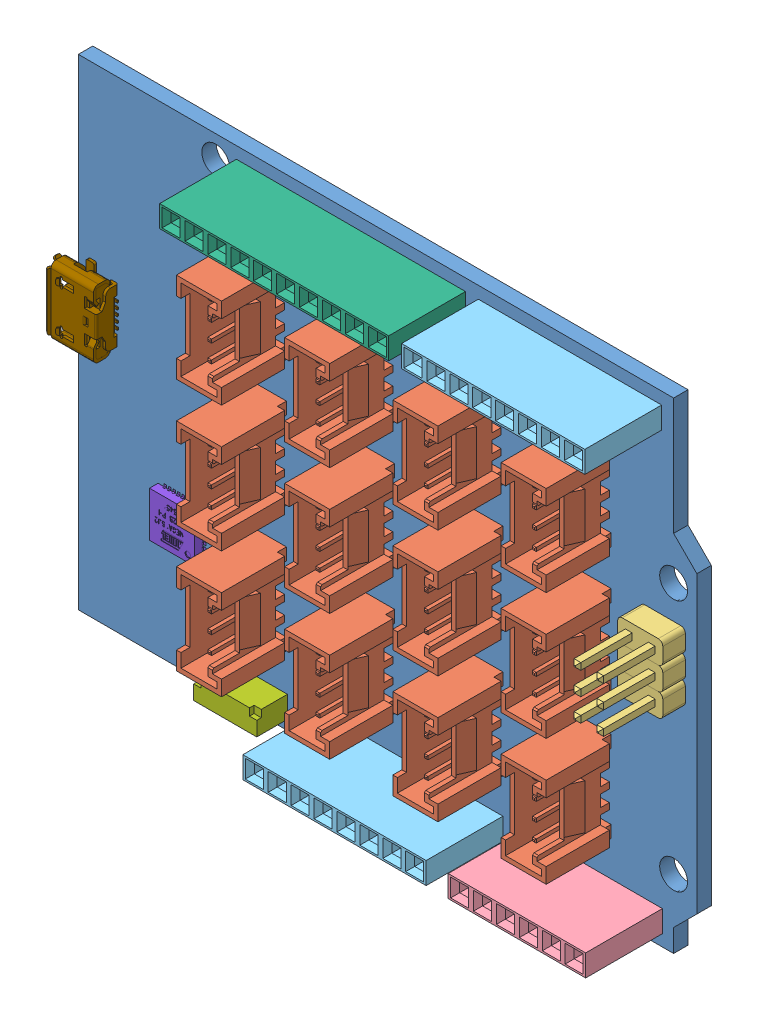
SolidWorks assembly Lotus seeedstudio.SLDASM, configuration Défaut (file format 14000). Lengths in mm.
Overall size (69.58 53.34 11.76).
23 component instances, 9 part files, 27 mates.
Components (placement in the parent):
- PCB Lotus-1: PCB Lotus.SLDPRT [Défaut] at (-41.2611 -23.1126 -0.8) size (68.58 53.34 1.6)
- Connecteur Grove (droit)-1: Connecteur Grove (droit).SLDPRT [Défaut] at (-17.3889 -10.5311 0.8) x (0 1 0) z (1 0 0) size (10 11 5)
- Connecteur Grove (droit)-2: Connecteur Grove (droit).SLDPRT [Défaut] at (-5.3889 -10.5311 0.8) x (0 1 0) z (1 0 0) size (10 11 5)
- Connecteur Grove (droit)-3: Connecteur Grove (droit).SLDPRT [Défaut] at (6.6111 -10.5311 0.8) x (0 1 0) z (1 0 0) size (10 11 5)
- Connecteur Grove (droit)-4: Connecteur Grove (droit).SLDPRT [Défaut] at (18.6111 -10.5311 0.8) x (0 1 0) z (1 0 0) size (10 11 5)
- Connecteur Grove (droit)-5: Connecteur Grove (droit).SLDPRT [Défaut] at (-17.3889 3.4689 0.8) x (0 1 0) z (1 0 0) size (10 11 5)
- Connecteur Grove (droit)-6: Connecteur Grove (droit).SLDPRT [Défaut] at (-5.3889 3.4689 0.8) x (0 1 0) z (1 0 0) size (10 11 5)
- Connecteur Grove (droit)-7: Connecteur Grove (droit).SLDPRT [Défaut] at (6.6111 3.4689 0.8) x (0 1 0) z (1 0 0) size (10 11 5)
- Connecteur Grove (droit)-8: Connecteur Grove (droit).SLDPRT [Défaut] at (18.6111 3.4689 0.8) x (0 1 0) z (1 0 0) size (10 11 5)
- Connecteur Grove (droit)-9: Connecteur Grove (droit).SLDPRT [Défaut] at (-17.3889 17.4689 0.8) x (0 1 0) z (1 0 0) size (10 11 5)
- Connecteur Grove (droit)-10: Connecteur Grove (droit).SLDPRT [Défaut] at (-5.3889 17.4689 0.8) x (0 1 0) z (1 0 0) size (10 11 5)
- Connecteur Grove (droit)-11: Connecteur Grove (droit).SLDPRT [Défaut] at (6.6111 17.4689 0.8) x (0 1 0) z (1 0 0) size (10 11 5)
- Connecteur Grove (droit)-12: Connecteur Grove (droit).SLDPRT [Défaut] at (18.6111 17.4689 0.8) x (0 1 0) z (1 0 0) size (10 11 5)
- 2pin_header__02 Y-1: 2pin_header__02 Y.SLDPRT [Default] at (23.5406 7.504 0.8) x (1 0 0) z (0 -1 0) size (5 11.75 2.54)
- 6 PORT HEADER Y-1: 6 PORT HEADER Y.SLDPRT [Default] at (9.5283 -20.6231 0.8) x (1 0 0) z (0 -1 0) size (15.24 10.51 2.41)
- 8 PORT HEADER Y-1: 8 PORT HEADER Y.SLDPRT [Default] at (-13.2368 -20.594 0.8) x (1 0 0) z (0 -1 0) size (20.32 10.51 2.41)
- 8 PORT HEADER Y-2: 8 PORT HEADER Y.SLDPRT [Default] at (4.3577 27.6832 0.8) x (1 0 0) z (0 -1 0) size (20.32 10.51 2.41)
- 10 PORT HEADER Y-1: 10 PORT HEADER Y.SLDPRT [Default] at (-22.4666 27.7113 0.8) x (1 0 0) z (0 -1 0) size (25.4 10.51 2.41)
- 2pin_header__02 Y-2: 2pin_header__02 Y.SLDPRT [Default] at (23.5406 4.964 0.8) x (1 0 0) z (0 -1 0) size (5 11.75 2.54)
- 2pin_header__02 Y-3: 2pin_header__02 Y.SLDPRT [Default] at (23.5406 2.424 0.8) x (1 0 0) z (0 -1 0) size (5 11.75 2.54)
- Bouton_RST - CMS-1: Bouton_RST - CMS.SLDPRT [Défaut] at (-21.577 -20.8281 0.8) x (1 0 0) z (0 -1 0) size (7 3.4 3.4)
- atmega16u2-1: atmega16u2.SLDPRT [Default] at (-29.8717 -8.9881 0.85) x (1 0 0) z (0 1 0) size (5.5 1.01 5.5)
- micro_usb_47346-0001-1: micro_usb_47346-0001.SLDPRT [Default] at (-39.4811 7.4215 2.025) x (0 -1 0) z (-1 0 0) size (7.98 2.94 5.43)
Mates (geometry in assembly coordinates):
- Coïncidente1: coincident anti-aligned: plane of PCB Lotus-1 through (-41.2611 -23.1126 0.8) normal (0 0 1); plane of Connecteur Grove (droit)-1 through (-17.3889 -10.5311 0.8) normal (0 0 -1)
- Parallèle1: parallel aligned: plane of PCB Lotus-1 through (-41.2611 -23.1126 0.8) normal (-1 0 0); plane of Connecteur Grove (droit)-1 through (-22.3889 -15.5311 8.8) normal (-1 0 0)
- Verrouiller1: lock: unknown of PCB Lotus-1; unknown of Connecteur Grove (droit)-1
- Coïncidente3: coincident anti-aligned: plane of PCB Lotus-1 through (-41.2611 -23.1126 0.8) normal (0 0 1); plane of 6 PORT HEADER Y-1 through (9.5283 -20.6231 0.8) normal (0 0 -1)
- Coïncidente4: coincident anti-aligned: plane of PCB Lotus-1 through (-41.2611 -23.1126 0.8) normal (0 0 1); plane of 8 PORT HEADER Y-1 through (-13.2368 -20.594 0.8) normal (0 0 -1)
- Coïncidente5: coincident anti-aligned: plane of PCB Lotus-1 through (-41.2611 -23.1126 0.8) normal (0 0 1); plane of 8 PORT HEADER Y-2 through (4.3577 27.6832 0.8) normal (0 0 -1)
- Coïncidente6: coincident anti-aligned: plane of PCB Lotus-1 through (-41.2611 -23.1126 0.8) normal (0 0 1); plane of 10 PORT HEADER Y-1 through (-22.4666 27.7113 0.8) normal (0 0 -1)
- Parallèle3: parallel aligned: line of PCB Lotus-1 through (-19.3611 -23.1126 0.8) axis (1 0 0); line of 6 PORT HEADER Y-1 through (8.2583 -21.8281 0.8) axis (1 0 0)
- Parallèle4: parallel aligned: line of PCB Lotus-1 through (-19.3611 -23.1126 0.8) axis (1 0 0); line of 10 PORT HEADER Y-1 through (-23.7366 26.5063 0.8) axis (1 0 0)
- Parallèle5: parallel aligned: line of PCB Lotus-1 through (-19.3611 -23.1126 0.8) axis (1 0 0); line of 8 PORT HEADER Y-1 through (-14.5068 -21.799 0.8) axis (1 0 0)
- Parallèle6: parallel aligned: line of PCB Lotus-1 through (-19.3611 -23.1126 0.8) axis (1 0 0); line of 8 PORT HEADER Y-2 through (3.0877 26.4782 0.8) axis (1 0 0)
- Parallèle7: parallel: plane of PCB Lotus-1 through (-41.2611 -23.1126 0.8) normal (0 0 1); line of 2pin_header__02 Y-1 through (21.5406 6.234 0.8) axis (1 0 0)
- Coïncidente13: coincident anti-aligned: plane of PCB Lotus-1 through (-41.2611 -23.1126 0.8) normal (0 0 1); plane of 2pin_header__02 Y-1 through (25.5406 6.734 0.8) normal (0 0 -1)
- Verrouiller2: lock: unknown of PCB Lotus-1; unknown of 2pin_header__02 Y-1
- Verrouiller3: lock: unknown of PCB Lotus-1; unknown of 6 PORT HEADER Y-1
- Verrouiller4: lock: unknown of PCB Lotus-1; unknown of 8 PORT HEADER Y-1
- Verrouiller5: lock: unknown of PCB Lotus-1; unknown of 8 PORT HEADER Y-2
- Verrouiller6: lock: unknown of PCB Lotus-1; unknown of 10 PORT HEADER Y-1
- Coïncidente17: coincident anti-aligned: plane of PCB Lotus-1 through (-41.2611 -23.1126 0.8) normal (0 0 1); plane of atmega16u2-1 through (-28.2717 -10.5881 0.8) normal (0 0 -1)
- Coïncidente18: coincident anti-aligned: plane of PCB Lotus-1 through (-41.2611 -23.1126 0.8) normal (0 0 1); plane of Bouton_RST - CMS-1 through (-21.577 -20.8281 0.8) normal (0 0 -1)
- Parallèle8: parallel aligned: plane of PCB Lotus-1 through (-41.2611 -23.1126 0.8) normal (-1 0 0); plane of atmega16u2-1 through (-32.3717 -11.4881 1.8) normal (-1 0 0)
- Parallèle9: parallel aligned: plane of PCB Lotus-1 through (24.7389 -23.1126 0.8) normal (0 -1 0); plane of Bouton_RST - CMS-1 through (-25.077 -22.0281 4.2) normal (0 -1 0)
- Verrouiller7: lock: unknown of PCB Lotus-1; unknown of atmega16u2-1
- Verrouiller8: lock: unknown of PCB Lotus-1; unknown of Bouton_RST - CMS-1
- Coïncidente19: coincident anti-aligned: plane of PCB Lotus-1 through (-41.2611 -23.1126 0.8) normal (0 0 1); plane of micro_usb_47346-0001-1 through (-37.1311 10.0179 0.8) normal (0 0 -1)
- Distance1: distance = 1 mm: line of micro_usb_47346-0001-1 through (-42.2611 7.6315 0.7421) axis (0 1 0); plane of PCB Lotus-1 through (-41.2611 -23.1126 0.8) normal (-1 0 0)
- Distance2: distance = 26.7841 mm aligned: plane of PCB Lotus-1 through (-23.7611 -23.1126 0.8) normal (0 -1 0); plane of micro_usb_47346-0001-1 through (-37.1311 3.6715 1.9536) normal (0 -1 0)
